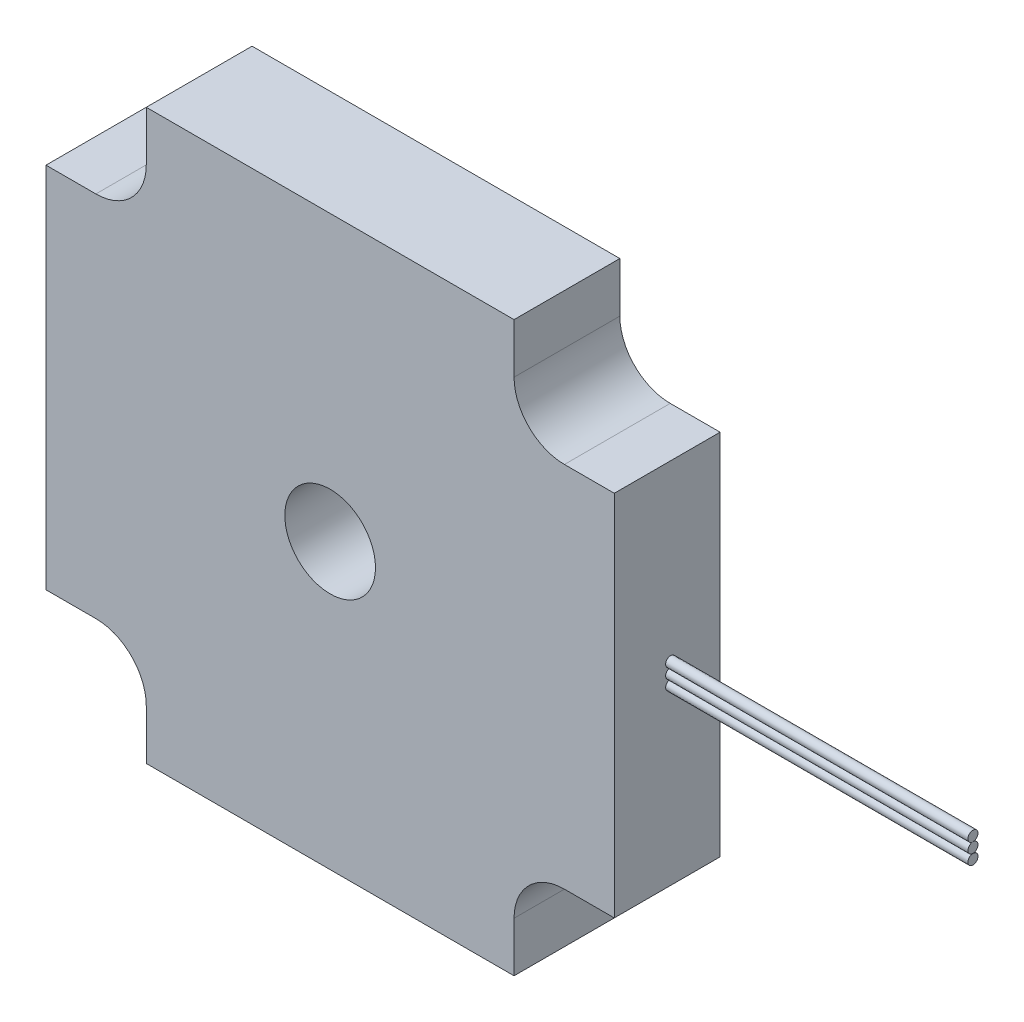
ISO-10303-21;
HEADER;
FILE_DESCRIPTION(('STEP AP214'),'2;1');
FILE_NAME('part.step','',(''),(''),'','','');
FILE_SCHEMA(('AUTOMOTIVE_DESIGN { 1 0 10303 214 1 1 1 1 }'));
ENDSEC;
DATA;
#1=APPLICATION_CONTEXT('core data for automotive mechanical design processes');
#2=APPLICATION_PROTOCOL_DEFINITION('international standard','automotive_design',2000,#1);
#3=PRODUCT_CONTEXT('',#1,'mechanical');
#4=PRODUCT('Part','Part','',(#3));
#5=PRODUCT_RELATED_PRODUCT_CATEGORY('part','',(#4));
#6=PRODUCT_DEFINITION_FORMATION('','',#4);
#7=PRODUCT_DEFINITION_CONTEXT('part definition',#1,'design');
#8=PRODUCT_DEFINITION('design','',#6,#7);
#9=PRODUCT_DEFINITION_SHAPE('','',#8);
#10=(LENGTH_UNIT() NAMED_UNIT(*) SI_UNIT(.MILLI.,.METRE.));
#11=(NAMED_UNIT(*) PLANE_ANGLE_UNIT() SI_UNIT($,.RADIAN.));
#12=(NAMED_UNIT(*) SI_UNIT($,.STERADIAN.) SOLID_ANGLE_UNIT());
#13=UNCERTAINTY_MEASURE_WITH_UNIT(LENGTH_MEASURE(1.E-05),#10,'distance_accuracy_value','');
#14=(GEOMETRIC_REPRESENTATION_CONTEXT(3) GLOBAL_UNCERTAINTY_ASSIGNED_CONTEXT((#13)) GLOBAL_UNIT_ASSIGNED_CONTEXT((#10,
#11,#12)) REPRESENTATION_CONTEXT('',''));
#15=CARTESIAN_POINT('',(0.,0.,0.));
#16=DIRECTION('',(0.,0.,1.));
#17=DIRECTION('',(1.,0.,0.));
#18=AXIS2_PLACEMENT_3D('',#15,#16,#17);
#19=CARTESIAN_POINT('',(58.2,0.999999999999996,4.90641702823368));
#20=DIRECTION('',(-1.,0.,0.));
#21=DIRECTION('',(0.,-1.,0.));
#22=AXIS2_PLACEMENT_3D('',#19,#20,#21);
#23=CYLINDRICAL_SURFACE('',#22,0.500000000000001);
#24=CARTESIAN_POINT('',(28.2,0.999999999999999,4.90641702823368));
#25=DIRECTION('',(1.,0.,0.));
#26=DIRECTION('',(0.,1.,0.));
#27=AXIS2_PLACEMENT_3D('',#24,#25,#26);
#28=CIRCLE('',#27,0.500000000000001);
#29=CARTESIAN_POINT('',(28.2,1.5,4.90641702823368));
#30=VERTEX_POINT('',#29);
#31=EDGE_CURVE('E11',#30,#30,#28,.T.);
#32=ORIENTED_EDGE('',*,*,#31,.T.);
#33=EDGE_LOOP('',(#32));
#34=FACE_BOUND('',#33,.T.);
#35=CARTESIAN_POINT('',(58.2,0.999999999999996,4.90641702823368));
#36=DIRECTION('',(1.,0.,0.));
#37=DIRECTION('',(0.,1.,0.));
#38=AXIS2_PLACEMENT_3D('',#35,#36,#37);
#39=CIRCLE('',#38,0.500000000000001);
#40=CARTESIAN_POINT('',(58.2,1.5,4.90641702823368));
#41=VERTEX_POINT('',#40);
#42=EDGE_CURVE('E46',#41,#41,#39,.T.);
#43=ORIENTED_EDGE('',*,*,#42,.F.);
#44=EDGE_LOOP('',(#43));
#45=FACE_BOUND('',#44,.T.);
#46=ADVANCED_FACE('F42',(#34,#45),#23,.T.);
#47=CARTESIAN_POINT('',(58.2,0.999999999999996,4.90641702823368));
#48=DIRECTION('',(1.,0.,0.));
#49=DIRECTION('',(0.,1.,0.));
#50=AXIS2_PLACEMENT_3D('',#47,#48,#49);
#51=PLANE('',#50);
#52=ORIENTED_EDGE('',*,*,#42,.T.);
#53=EDGE_LOOP('',(#52));
#54=FACE_BOUND('',#53,.T.);
#55=ADVANCED_FACE('F44',(#54),#51,.T.);
#56=CARTESIAN_POINT('',(28.2,0.999999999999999,4.90641702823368));
#57=DIRECTION('',(1.,0.,0.));
#58=DIRECTION('',(0.,1.,0.));
#59=AXIS2_PLACEMENT_3D('',#56,#57,#58);
#60=PLANE('',#59);
#61=ORIENTED_EDGE('',*,*,#31,.F.);
#62=EDGE_LOOP('',(#61));
#63=FACE_BOUND('',#62,.T.);
#64=ADVANCED_FACE('F61',(#63),#60,.F.);
#65=CLOSED_SHELL('',(#46,#55,#64));
#66=MANIFOLD_SOLID_BREP('B2',#65);
#67=CARTESIAN_POINT('',(58.2,-1.00000000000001,4.90641702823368));
#68=DIRECTION('',(-1.,0.,0.));
#69=DIRECTION('',(0.,-1.,0.));
#70=AXIS2_PLACEMENT_3D('',#67,#68,#69);
#71=CYLINDRICAL_SURFACE('',#70,0.500000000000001);
#72=CARTESIAN_POINT('',(28.2,-1.,4.90641702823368));
#73=DIRECTION('',(1.,0.,0.));
#74=DIRECTION('',(0.,1.,0.));
#75=AXIS2_PLACEMENT_3D('',#72,#73,#74);
#76=CIRCLE('',#75,0.500000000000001);
#77=CARTESIAN_POINT('',(28.2,-0.500000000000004,4.90641702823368));
#78=VERTEX_POINT('',#77);
#79=EDGE_CURVE('E41',#78,#78,#76,.T.);
#80=ORIENTED_EDGE('',*,*,#79,.T.);
#81=EDGE_LOOP('',(#80));
#82=FACE_BOUND('',#81,.T.);
#83=CARTESIAN_POINT('',(58.2,-1.00000000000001,4.90641702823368));
#84=DIRECTION('',(1.,0.,0.));
#85=DIRECTION('',(0.,1.,0.));
#86=AXIS2_PLACEMENT_3D('',#83,#84,#85);
#87=CIRCLE('',#86,0.500000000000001);
#88=CARTESIAN_POINT('',(58.2,-0.500000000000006,4.90641702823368));
#89=VERTEX_POINT('',#88);
#90=EDGE_CURVE('E95',#89,#89,#87,.T.);
#91=ORIENTED_EDGE('',*,*,#90,.F.);
#92=EDGE_LOOP('',(#91));
#93=FACE_BOUND('',#92,.T.);
#94=ADVANCED_FACE('F91',(#82,#93),#71,.T.);
#95=CARTESIAN_POINT('',(58.2,-1.00000000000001,4.90641702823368));
#96=DIRECTION('',(1.,0.,0.));
#97=DIRECTION('',(0.,1.,0.));
#98=AXIS2_PLACEMENT_3D('',#95,#96,#97);
#99=PLANE('',#98);
#100=ORIENTED_EDGE('',*,*,#90,.T.);
#101=EDGE_LOOP('',(#100));
#102=FACE_BOUND('',#101,.T.);
#103=ADVANCED_FACE('F93',(#102),#99,.T.);
#104=CARTESIAN_POINT('',(28.2,-1.,4.90641702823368));
#105=DIRECTION('',(1.,0.,0.));
#106=DIRECTION('',(0.,1.,0.));
#107=AXIS2_PLACEMENT_3D('',#104,#105,#106);
#108=PLANE('',#107);
#109=ORIENTED_EDGE('',*,*,#79,.F.);
#110=EDGE_LOOP('',(#109));
#111=FACE_BOUND('',#110,.T.);
#112=ADVANCED_FACE('F110',(#111),#108,.F.);
#113=CLOSED_SHELL('',(#94,#103,#112));
#114=MANIFOLD_SOLID_BREP('B6',#113);
#115=CARTESIAN_POINT('',(58.2,0.,4.90641702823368));
#116=DIRECTION('',(-1.,0.,0.));
#117=DIRECTION('',(0.,-1.,0.));
#118=AXIS2_PLACEMENT_3D('',#115,#116,#117);
#119=CYLINDRICAL_SURFACE('',#118,0.500000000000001);
#120=CARTESIAN_POINT('',(28.2,0.,4.90641702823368));
#121=DIRECTION('',(1.,0.,0.));
#122=DIRECTION('',(0.,1.,0.));
#123=AXIS2_PLACEMENT_3D('',#120,#121,#122);
#124=CIRCLE('',#123,0.500000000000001);
#125=CARTESIAN_POINT('',(28.2,0.499999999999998,4.90641702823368));
#126=VERTEX_POINT('',#125);
#127=EDGE_CURVE('E144',#126,#126,#124,.T.);
#128=ORIENTED_EDGE('',*,*,#127,.T.);
#129=EDGE_LOOP('',(#128));
#130=FACE_BOUND('',#129,.T.);
#131=CARTESIAN_POINT('',(58.2,0.,4.90641702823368));
#132=DIRECTION('',(1.,0.,0.));
#133=DIRECTION('',(0.,1.,0.));
#134=AXIS2_PLACEMENT_3D('',#131,#132,#133);
#135=CIRCLE('',#134,0.500000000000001);
#136=CARTESIAN_POINT('',(58.2,0.499999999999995,4.90641702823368));
#137=VERTEX_POINT('',#136);
#138=EDGE_CURVE('E90',#137,#137,#135,.T.);
#139=ORIENTED_EDGE('',*,*,#138,.F.);
#140=EDGE_LOOP('',(#139));
#141=FACE_BOUND('',#140,.T.);
#142=ADVANCED_FACE('F141',(#130,#141),#119,.T.);
#143=CARTESIAN_POINT('',(58.2,0.,4.90641702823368));
#144=DIRECTION('',(1.,0.,0.));
#145=DIRECTION('',(0.,1.,0.));
#146=AXIS2_PLACEMENT_3D('',#143,#144,#145);
#147=PLANE('',#146);
#148=ORIENTED_EDGE('',*,*,#138,.T.);
#149=EDGE_LOOP('',(#148));
#150=FACE_BOUND('',#149,.T.);
#151=ADVANCED_FACE('F157',(#150),#147,.T.);
#152=CARTESIAN_POINT('',(28.2,0.,4.90641702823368));
#153=DIRECTION('',(1.,0.,0.));
#154=DIRECTION('',(0.,1.,0.));
#155=AXIS2_PLACEMENT_3D('',#152,#153,#154);
#156=PLANE('',#155);
#157=ORIENTED_EDGE('',*,*,#127,.F.);
#158=EDGE_LOOP('',(#157));
#159=FACE_BOUND('',#158,.T.);
#160=ADVANCED_FACE('F155',(#159),#156,.F.);
#161=CLOSED_SHELL('',(#142,#151,#160));
#162=MANIFOLD_SOLID_BREP('B36',#161);
#163=CARTESIAN_POINT('',(-28.2,-18.25,10.5));
#164=DIRECTION('',(1.,0.,0.));
#165=DIRECTION('',(0.,0.,-1.));
#166=AXIS2_PLACEMENT_3D('',#163,#164,#165);
#167=PLANE('',#166);
#168=DIRECTION('',(0.,-1.,0.));
#169=VECTOR('',#168,1.);
#170=CARTESIAN_POINT('',(-28.2,-18.25,0.));
#171=LINE('',#170,#169);
#172=CARTESIAN_POINT('',(-28.2,18.25,0.));
#173=VERTEX_POINT('',#172);
#174=CARTESIAN_POINT('',(-28.2,-18.25,0.));
#175=VERTEX_POINT('',#174);
#176=EDGE_CURVE('E319',#173,#175,#171,.T.);
#177=ORIENTED_EDGE('',*,*,#176,.T.);
#178=DIRECTION('',(0.,0.,-1.));
#179=VECTOR('',#178,1.);
#180=CARTESIAN_POINT('',(-28.2,-18.25,10.5));
#181=LINE('',#180,#179);
#182=CARTESIAN_POINT('',(-28.2,-18.25,10.5));
#183=VERTEX_POINT('',#182);
#184=EDGE_CURVE('E300',#183,#175,#181,.T.);
#185=ORIENTED_EDGE('',*,*,#184,.F.);
#186=DIRECTION('',(0.,-1.,0.));
#187=VECTOR('',#186,1.);
#188=CARTESIAN_POINT('',(-28.2,-18.25,10.5));
#189=LINE('',#188,#187);
#190=CARTESIAN_POINT('',(-28.2,18.25,10.5));
#191=VERTEX_POINT('',#190);
#192=EDGE_CURVE('E307',#191,#183,#189,.T.);
#193=ORIENTED_EDGE('',*,*,#192,.F.);
#194=DIRECTION('',(0.,0.,-1.));
#195=VECTOR('',#194,1.);
#196=CARTESIAN_POINT('',(-28.2,18.25,10.5));
#197=LINE('',#196,#195);
#198=EDGE_CURVE('E366',#191,#173,#197,.T.);
#199=ORIENTED_EDGE('',*,*,#198,.T.);
#200=EDGE_LOOP('',(#177,#185,#193,#199));
#201=FACE_BOUND('',#200,.T.);
#202=ADVANCED_FACE('F182',(#201),#167,.F.);
#203=CARTESIAN_POINT('',(-18.25,-18.25,10.5));
#204=DIRECTION('',(0.,1.,0.));
#205=DIRECTION('',(-1.,0.,0.));
#206=AXIS2_PLACEMENT_3D('',#203,#204,#205);
#207=PLANE('',#206);
#208=DIRECTION('',(1.,0.,0.));
#209=VECTOR('',#208,1.);
#210=CARTESIAN_POINT('',(-18.25,-18.25,0.));
#211=LINE('',#210,#209);
#212=CARTESIAN_POINT('',(-23.25,-18.25,0.));
#213=VERTEX_POINT('',#212);
#214=EDGE_CURVE('E440',#175,#213,#211,.T.);
#215=ORIENTED_EDGE('',*,*,#214,.T.);
#216=DIRECTION('',(0.,0.,-1.));
#217=VECTOR('',#216,1.);
#218=CARTESIAN_POINT('',(-23.25,-18.25,10.5));
#219=LINE('',#218,#217);
#220=CARTESIAN_POINT('',(-23.25,-18.25,10.5));
#221=VERTEX_POINT('',#220);
#222=EDGE_CURVE('E303',#213,#221,#219,.F.);
#223=ORIENTED_EDGE('',*,*,#222,.T.);
#224=DIRECTION('',(1.,0.,0.));
#225=VECTOR('',#224,1.);
#226=CARTESIAN_POINT('',(-18.25,-18.25,10.5));
#227=LINE('',#226,#225);
#228=EDGE_CURVE('E295',#183,#221,#227,.T.);
#229=ORIENTED_EDGE('',*,*,#228,.F.);
#230=ORIENTED_EDGE('',*,*,#184,.T.);
#231=EDGE_LOOP('',(#215,#223,#229,#230));
#232=FACE_BOUND('',#231,.T.);
#233=ADVANCED_FACE('F298',(#232),#207,.F.);
#234=CARTESIAN_POINT('',(-18.25,-28.2,10.5));
#235=DIRECTION('',(1.,0.,0.));
#236=DIRECTION('',(0.,1.,0.));
#237=AXIS2_PLACEMENT_3D('',#234,#235,#236);
#238=PLANE('',#237);
#239=DIRECTION('',(0.,-1.,0.));
#240=VECTOR('',#239,1.);
#241=CARTESIAN_POINT('',(-18.25,-28.2,10.5));
#242=LINE('',#241,#240);
#243=CARTESIAN_POINT('',(-18.25,-23.25,10.5));
#244=VERTEX_POINT('',#243);
#245=CARTESIAN_POINT('',(-18.25,-28.2,10.5));
#246=VERTEX_POINT('',#245);
#247=EDGE_CURVE('E306',#244,#246,#242,.T.);
#248=ORIENTED_EDGE('',*,*,#247,.F.);
#249=DIRECTION('',(0.,0.,-1.));
#250=VECTOR('',#249,1.);
#251=CARTESIAN_POINT('',(-18.25,-23.25,0.));
#252=LINE('',#251,#250);
#253=CARTESIAN_POINT('',(-18.25,-23.25,0.));
#254=VERTEX_POINT('',#253);
#255=EDGE_CURVE('E332',#244,#254,#252,.T.);
#256=ORIENTED_EDGE('',*,*,#255,.T.);
#257=DIRECTION('',(0.,-1.,0.));
#258=VECTOR('',#257,1.);
#259=CARTESIAN_POINT('',(-18.25,-28.2,0.));
#260=LINE('',#259,#258);
#261=CARTESIAN_POINT('',(-18.25,-28.2,0.));
#262=VERTEX_POINT('',#261);
#263=EDGE_CURVE('E417',#254,#262,#260,.T.);
#264=ORIENTED_EDGE('',*,*,#263,.T.);
#265=DIRECTION('',(0.,0.,-1.));
#266=VECTOR('',#265,1.);
#267=CARTESIAN_POINT('',(-18.25,-28.2,10.5));
#268=LINE('',#267,#266);
#269=EDGE_CURVE('E321',#246,#262,#268,.T.);
#270=ORIENTED_EDGE('',*,*,#269,.F.);
#271=EDGE_LOOP('',(#248,#256,#264,#270));
#272=FACE_BOUND('',#271,.T.);
#273=ADVANCED_FACE('F445',(#272),#238,.F.);
#274=CARTESIAN_POINT('',(18.25,-28.2,10.5));
#275=DIRECTION('',(0.,1.,0.));
#276=DIRECTION('',(0.,0.,1.));
#277=AXIS2_PLACEMENT_3D('',#274,#275,#276);
#278=PLANE('',#277);
#279=DIRECTION('',(1.,0.,0.));
#280=VECTOR('',#279,1.);
#281=CARTESIAN_POINT('',(18.25,-28.2,0.));
#282=LINE('',#281,#280);
#283=CARTESIAN_POINT('',(18.25,-28.2,0.));
#284=VERTEX_POINT('',#283);
#285=EDGE_CURVE('E411',#262,#284,#282,.T.);
#286=ORIENTED_EDGE('',*,*,#285,.T.);
#287=DIRECTION('',(0.,0.,-1.));
#288=VECTOR('',#287,1.);
#289=CARTESIAN_POINT('',(18.25,-28.2,10.5));
#290=LINE('',#289,#288);
#291=CARTESIAN_POINT('',(18.25,-28.2,10.5));
#292=VERTEX_POINT('',#291);
#293=EDGE_CURVE('E327',#292,#284,#290,.T.);
#294=ORIENTED_EDGE('',*,*,#293,.F.);
#295=DIRECTION('',(1.,0.,0.));
#296=VECTOR('',#295,1.);
#297=CARTESIAN_POINT('',(18.25,-28.2,10.5));
#298=LINE('',#297,#296);
#299=EDGE_CURVE('E448',#246,#292,#298,.T.);
#300=ORIENTED_EDGE('',*,*,#299,.F.);
#301=ORIENTED_EDGE('',*,*,#269,.T.);
#302=EDGE_LOOP('',(#286,#294,#300,#301));
#303=FACE_BOUND('',#302,.T.);
#304=ADVANCED_FACE('F447',(#303),#278,.F.);
#305=CARTESIAN_POINT('',(18.25,-28.2,10.5));
#306=DIRECTION('',(-1.,0.,0.));
#307=DIRECTION('',(0.,0.,1.));
#308=AXIS2_PLACEMENT_3D('',#305,#306,#307);
#309=PLANE('',#308);
#310=DIRECTION('',(0.,1.,0.));
#311=VECTOR('',#310,1.);
#312=CARTESIAN_POINT('',(18.25,-28.2,0.));
#313=LINE('',#312,#311);
#314=CARTESIAN_POINT('',(18.25,-23.25,0.));
#315=VERTEX_POINT('',#314);
#316=EDGE_CURVE('E403',#284,#315,#313,.T.);
#317=ORIENTED_EDGE('',*,*,#316,.T.);
#318=DIRECTION('',(0.,0.,-1.));
#319=VECTOR('',#318,1.);
#320=CARTESIAN_POINT('',(18.25,-23.25,10.5));
#321=LINE('',#320,#319);
#322=CARTESIAN_POINT('',(18.25,-23.25,10.5));
#323=VERTEX_POINT('',#322);
#324=EDGE_CURVE('E324',#315,#323,#321,.F.);
#325=ORIENTED_EDGE('',*,*,#324,.T.);
#326=DIRECTION('',(0.,1.,0.));
#327=VECTOR('',#326,1.);
#328=CARTESIAN_POINT('',(18.25,-28.2,10.5));
#329=LINE('',#328,#327);
#330=EDGE_CURVE('E406',#292,#323,#329,.T.);
#331=ORIENTED_EDGE('',*,*,#330,.F.);
#332=ORIENTED_EDGE('',*,*,#293,.T.);
#333=EDGE_LOOP('',(#317,#325,#331,#332));
#334=FACE_BOUND('',#333,.T.);
#335=ADVANCED_FACE('F402',(#334),#309,.F.);
#336=CARTESIAN_POINT('',(28.2,-18.25,10.5));
#337=DIRECTION('',(0.,1.,0.));
#338=DIRECTION('',(-1.,0.,0.));
#339=AXIS2_PLACEMENT_3D('',#336,#337,#338);
#340=PLANE('',#339);
#341=DIRECTION('',(1.,0.,0.));
#342=VECTOR('',#341,1.);
#343=CARTESIAN_POINT('',(28.2,-18.25,10.5));
#344=LINE('',#343,#342);
#345=CARTESIAN_POINT('',(23.25,-18.25,10.5));
#346=VERTEX_POINT('',#345);
#347=CARTESIAN_POINT('',(28.2,-18.25,10.5));
#348=VERTEX_POINT('',#347);
#349=EDGE_CURVE('E450',#346,#348,#344,.T.);
#350=ORIENTED_EDGE('',*,*,#349,.F.);
#351=DIRECTION('',(0.,0.,-1.));
#352=VECTOR('',#351,1.);
#353=CARTESIAN_POINT('',(23.25,-18.25,0.));
#354=LINE('',#353,#352);
#355=CARTESIAN_POINT('',(23.25,-18.25,0.));
#356=VERTEX_POINT('',#355);
#357=EDGE_CURVE('E320',#346,#356,#354,.T.);
#358=ORIENTED_EDGE('',*,*,#357,.T.);
#359=DIRECTION('',(1.,0.,0.));
#360=VECTOR('',#359,1.);
#361=CARTESIAN_POINT('',(28.2,-18.25,0.));
#362=LINE('',#361,#360);
#363=CARTESIAN_POINT('',(28.2,-18.25,0.));
#364=VERTEX_POINT('',#363);
#365=EDGE_CURVE('E413',#356,#364,#362,.T.);
#366=ORIENTED_EDGE('',*,*,#365,.T.);
#367=DIRECTION('',(0.,0.,-1.));
#368=VECTOR('',#367,1.);
#369=CARTESIAN_POINT('',(28.2,-18.25,10.5));
#370=LINE('',#369,#368);
#371=EDGE_CURVE('E394',#348,#364,#370,.T.);
#372=ORIENTED_EDGE('',*,*,#371,.F.);
#373=EDGE_LOOP('',(#350,#358,#366,#372));
#374=FACE_BOUND('',#373,.T.);
#375=ADVANCED_FACE('F571',(#374),#340,.F.);
#376=CARTESIAN_POINT('',(28.2,-18.25,10.5));
#377=DIRECTION('',(-1.,0.,0.));
#378=DIRECTION('',(0.,-1.,0.));
#379=AXIS2_PLACEMENT_3D('',#376,#377,#378);
#380=PLANE('',#379);
#381=DIRECTION('',(0.,1.,0.));
#382=VECTOR('',#381,1.);
#383=CARTESIAN_POINT('',(28.2,-18.25,0.));
#384=LINE('',#383,#382);
#385=CARTESIAN_POINT('',(28.2,18.25,0.));
#386=VERTEX_POINT('',#385);
#387=EDGE_CURVE('E415',#364,#386,#384,.T.);
#388=ORIENTED_EDGE('',*,*,#387,.T.);
#389=DIRECTION('',(0.,0.,-1.));
#390=VECTOR('',#389,1.);
#391=CARTESIAN_POINT('',(28.2,18.25,10.5));
#392=LINE('',#391,#390);
#393=CARTESIAN_POINT('',(28.2,18.25,10.5));
#394=VERTEX_POINT('',#393);
#395=EDGE_CURVE('E391',#394,#386,#392,.T.);
#396=ORIENTED_EDGE('',*,*,#395,.F.);
#397=DIRECTION('',(0.,1.,0.));
#398=VECTOR('',#397,1.);
#399=CARTESIAN_POINT('',(28.2,-18.25,10.5));
#400=LINE('',#399,#398);
#401=EDGE_CURVE('E455',#348,#394,#400,.T.);
#402=ORIENTED_EDGE('',*,*,#401,.F.);
#403=ORIENTED_EDGE('',*,*,#371,.T.);
#404=EDGE_LOOP('',(#388,#396,#402,#403));
#405=FACE_BOUND('',#404,.T.);
#406=ADVANCED_FACE('F563',(#405),#380,.F.);
#407=CARTESIAN_POINT('',(28.2,18.25,10.5));
#408=DIRECTION('',(0.,-1.,0.));
#409=DIRECTION('',(0.,0.,-1.));
#410=AXIS2_PLACEMENT_3D('',#407,#408,#409);
#411=PLANE('',#410);
#412=DIRECTION('',(-1.,0.,0.));
#413=VECTOR('',#412,1.);
#414=CARTESIAN_POINT('',(28.2,18.25,0.));
#415=LINE('',#414,#413);
#416=CARTESIAN_POINT('',(23.25,18.25,0.));
#417=VERTEX_POINT('',#416);
#418=EDGE_CURVE('E422',#386,#417,#415,.T.);
#419=ORIENTED_EDGE('',*,*,#418,.T.);
#420=DIRECTION('',(0.,0.,-1.));
#421=VECTOR('',#420,1.);
#422=CARTESIAN_POINT('',(23.25,18.25,10.5));
#423=LINE('',#422,#421);
#424=CARTESIAN_POINT('',(23.25,18.25,10.5));
#425=VERTEX_POINT('',#424);
#426=EDGE_CURVE('E197',#417,#425,#423,.F.);
#427=ORIENTED_EDGE('',*,*,#426,.T.);
#428=DIRECTION('',(-1.,0.,0.));
#429=VECTOR('',#428,1.);
#430=CARTESIAN_POINT('',(28.2,18.25,10.5));
#431=LINE('',#430,#429);
#432=EDGE_CURVE('E435',#394,#425,#431,.T.);
#433=ORIENTED_EDGE('',*,*,#432,.F.);
#434=ORIENTED_EDGE('',*,*,#395,.T.);
#435=EDGE_LOOP('',(#419,#427,#433,#434));
#436=FACE_BOUND('',#435,.T.);
#437=ADVANCED_FACE('F555',(#436),#411,.F.);
#438=CARTESIAN_POINT('',(18.25,18.25,10.5));
#439=DIRECTION('',(-1.,0.,0.));
#440=DIRECTION('',(0.,-1.,0.));
#441=AXIS2_PLACEMENT_3D('',#438,#439,#440);
#442=PLANE('',#441);
#443=DIRECTION('',(0.,1.,0.));
#444=VECTOR('',#443,1.);
#445=CARTESIAN_POINT('',(18.25,18.25,10.5));
#446=LINE('',#445,#444);
#447=CARTESIAN_POINT('',(18.25,23.25,10.5));
#448=VERTEX_POINT('',#447);
#449=CARTESIAN_POINT('',(18.25,28.2,10.5));
#450=VERTEX_POINT('',#449);
#451=EDGE_CURVE('E432',#448,#450,#446,.T.);
#452=ORIENTED_EDGE('',*,*,#451,.F.);
#453=DIRECTION('',(0.,0.,-1.));
#454=VECTOR('',#453,1.);
#455=CARTESIAN_POINT('',(18.25,23.25,0.));
#456=LINE('',#455,#454);
#457=CARTESIAN_POINT('',(18.25,23.25,0.));
#458=VERTEX_POINT('',#457);
#459=EDGE_CURVE('E341',#448,#458,#456,.T.);
#460=ORIENTED_EDGE('',*,*,#459,.T.);
#461=DIRECTION('',(0.,1.,0.));
#462=VECTOR('',#461,1.);
#463=CARTESIAN_POINT('',(18.25,18.25,0.));
#464=LINE('',#463,#462);
#465=CARTESIAN_POINT('',(18.25,28.2,0.));
#466=VERTEX_POINT('',#465);
#467=EDGE_CURVE('E382',#458,#466,#464,.T.);
#468=ORIENTED_EDGE('',*,*,#467,.T.);
#469=DIRECTION('',(0.,0.,-1.));
#470=VECTOR('',#469,1.);
#471=CARTESIAN_POINT('',(18.25,28.2,10.5));
#472=LINE('',#471,#470);
#473=EDGE_CURVE('E388',#450,#466,#472,.T.);
#474=ORIENTED_EDGE('',*,*,#473,.F.);
#475=EDGE_LOOP('',(#452,#460,#468,#474));
#476=FACE_BOUND('',#475,.T.);
#477=ADVANCED_FACE('F426',(#476),#442,.F.);
#478=CARTESIAN_POINT('',(18.25,28.2,10.5));
#479=DIRECTION('',(0.,-1.,0.));
#480=DIRECTION('',(0.,0.,-1.));
#481=AXIS2_PLACEMENT_3D('',#478,#479,#480);
#482=PLANE('',#481);
#483=DIRECTION('',(-1.,0.,0.));
#484=VECTOR('',#483,1.);
#485=CARTESIAN_POINT('',(18.25,28.2,0.));
#486=LINE('',#485,#484);
#487=CARTESIAN_POINT('',(-18.25,28.2,0.));
#488=VERTEX_POINT('',#487);
#489=EDGE_CURVE('E379',#466,#488,#486,.T.);
#490=ORIENTED_EDGE('',*,*,#489,.T.);
#491=DIRECTION('',(0.,0.,-1.));
#492=VECTOR('',#491,1.);
#493=CARTESIAN_POINT('',(-18.25,28.2,10.5));
#494=LINE('',#493,#492);
#495=CARTESIAN_POINT('',(-18.25,28.2,10.5));
#496=VERTEX_POINT('',#495);
#497=EDGE_CURVE('E378',#496,#488,#494,.T.);
#498=ORIENTED_EDGE('',*,*,#497,.F.);
#499=DIRECTION('',(-1.,0.,0.));
#500=VECTOR('',#499,1.);
#501=CARTESIAN_POINT('',(18.25,28.2,10.5));
#502=LINE('',#501,#500);
#503=EDGE_CURVE('E431',#450,#496,#502,.T.);
#504=ORIENTED_EDGE('',*,*,#503,.F.);
#505=ORIENTED_EDGE('',*,*,#473,.T.);
#506=EDGE_LOOP('',(#490,#498,#504,#505));
#507=FACE_BOUND('',#506,.T.);
#508=ADVANCED_FACE('F430',(#507),#482,.F.);
#509=CARTESIAN_POINT('',(-18.25,18.25,10.5));
#510=DIRECTION('',(1.,0.,0.));
#511=DIRECTION('',(0.,1.,0.));
#512=AXIS2_PLACEMENT_3D('',#509,#510,#511);
#513=PLANE('',#512);
#514=DIRECTION('',(0.,-1.,0.));
#515=VECTOR('',#514,1.);
#516=CARTESIAN_POINT('',(-18.25,18.25,0.));
#517=LINE('',#516,#515);
#518=CARTESIAN_POINT('',(-18.25,23.25,0.));
#519=VERTEX_POINT('',#518);
#520=EDGE_CURVE('E373',#488,#519,#517,.T.);
#521=ORIENTED_EDGE('',*,*,#520,.T.);
#522=DIRECTION('',(0.,0.,-1.));
#523=VECTOR('',#522,1.);
#524=CARTESIAN_POINT('',(-18.25,23.25,10.5));
#525=LINE('',#524,#523);
#526=CARTESIAN_POINT('',(-18.25,23.25,10.5));
#527=VERTEX_POINT('',#526);
#528=EDGE_CURVE('E339',#519,#527,#525,.F.);
#529=ORIENTED_EDGE('',*,*,#528,.T.);
#530=DIRECTION('',(0.,-1.,0.));
#531=VECTOR('',#530,1.);
#532=CARTESIAN_POINT('',(-18.25,18.25,10.5));
#533=LINE('',#532,#531);
#534=EDGE_CURVE('E359',#496,#527,#533,.T.);
#535=ORIENTED_EDGE('',*,*,#534,.F.);
#536=ORIENTED_EDGE('',*,*,#497,.T.);
#537=EDGE_LOOP('',(#521,#529,#535,#536));
#538=FACE_BOUND('',#537,.T.);
#539=ADVANCED_FACE('F376',(#538),#513,.F.);
#540=CARTESIAN_POINT('',(-18.25,18.25,10.5));
#541=DIRECTION('',(0.,-1.,0.));
#542=DIRECTION('',(1.,0.,0.));
#543=AXIS2_PLACEMENT_3D('',#540,#541,#542);
#544=PLANE('',#543);
#545=DIRECTION('',(-1.,0.,0.));
#546=VECTOR('',#545,1.);
#547=CARTESIAN_POINT('',(-18.25,18.25,10.5));
#548=LINE('',#547,#546);
#549=CARTESIAN_POINT('',(-23.25,18.25,10.5));
#550=VERTEX_POINT('',#549);
#551=EDGE_CURVE('E312',#550,#191,#548,.T.);
#552=ORIENTED_EDGE('',*,*,#551,.F.);
#553=DIRECTION('',(0.,0.,-1.));
#554=VECTOR('',#553,1.);
#555=CARTESIAN_POINT('',(-23.25,18.25,0.));
#556=LINE('',#555,#554);
#557=CARTESIAN_POINT('',(-23.25,18.25,0.));
#558=VERTEX_POINT('',#557);
#559=EDGE_CURVE('E336',#550,#558,#556,.T.);
#560=ORIENTED_EDGE('',*,*,#559,.T.);
#561=DIRECTION('',(-1.,0.,0.));
#562=VECTOR('',#561,1.);
#563=CARTESIAN_POINT('',(-18.25,18.25,0.));
#564=LINE('',#563,#562);
#565=EDGE_CURVE('E316',#558,#173,#564,.T.);
#566=ORIENTED_EDGE('',*,*,#565,.T.);
#567=ORIENTED_EDGE('',*,*,#198,.F.);
#568=EDGE_LOOP('',(#552,#560,#566,#567));
#569=FACE_BOUND('',#568,.T.);
#570=ADVANCED_FACE('F364',(#569),#544,.F.);
#571=CARTESIAN_POINT('',(0.,0.,10.5));
#572=DIRECTION('',(0.,0.,1.));
#573=DIRECTION('',(1.,0.,0.));
#574=AXIS2_PLACEMENT_3D('',#571,#572,#573);
#575=PLANE('',#574);
#576=CARTESIAN_POINT('',(0.,0.,10.5));
#577=DIRECTION('',(0.,0.,1.));
#578=DIRECTION('',(1.,0.,0.));
#579=AXIS2_PLACEMENT_3D('',#576,#577,#578);
#580=CIRCLE('',#579,4.5);
#581=CARTESIAN_POINT('',(4.5,0.,10.5));
#582=VERTEX_POINT('',#581);
#583=EDGE_CURVE('E630',#582,#582,#580,.T.);
#584=ORIENTED_EDGE('',*,*,#583,.F.);
#585=EDGE_LOOP('',(#584));
#586=FACE_BOUND('',#585,.T.);
#587=ORIENTED_EDGE('',*,*,#192,.T.);
#588=ORIENTED_EDGE('',*,*,#228,.T.);
#589=CARTESIAN_POINT('',(-23.25,-23.25,10.5));
#590=DIRECTION('',(0.,0.,1.));
#591=DIRECTION('',(1.,0.,0.));
#592=AXIS2_PLACEMENT_3D('',#589,#590,#591);
#593=CIRCLE('',#592,5.);
#594=EDGE_CURVE('E351',#221,#244,#593,.F.);
#595=ORIENTED_EDGE('',*,*,#594,.T.);
#596=ORIENTED_EDGE('',*,*,#247,.T.);
#597=ORIENTED_EDGE('',*,*,#299,.T.);
#598=ORIENTED_EDGE('',*,*,#330,.T.);
#599=CARTESIAN_POINT('',(23.25,-23.25,10.5));
#600=DIRECTION('',(0.,0.,1.));
#601=DIRECTION('',(1.,0.,0.));
#602=AXIS2_PLACEMENT_3D('',#599,#600,#601);
#603=CIRCLE('',#602,5.);
#604=EDGE_CURVE('E347',#323,#346,#603,.F.);
#605=ORIENTED_EDGE('',*,*,#604,.T.);
#606=ORIENTED_EDGE('',*,*,#349,.T.);
#607=ORIENTED_EDGE('',*,*,#401,.T.);
#608=ORIENTED_EDGE('',*,*,#432,.T.);
#609=CARTESIAN_POINT('',(23.25,23.25,10.5));
#610=DIRECTION('',(0.,0.,1.));
#611=DIRECTION('',(1.,0.,0.));
#612=AXIS2_PLACEMENT_3D('',#609,#610,#611);
#613=CIRCLE('',#612,5.);
#614=EDGE_CURVE('E139',#425,#448,#613,.F.);
#615=ORIENTED_EDGE('',*,*,#614,.T.);
#616=ORIENTED_EDGE('',*,*,#451,.T.);
#617=ORIENTED_EDGE('',*,*,#503,.T.);
#618=ORIENTED_EDGE('',*,*,#534,.T.);
#619=CARTESIAN_POINT('',(-23.25,23.25,10.5));
#620=DIRECTION('',(0.,0.,1.));
#621=DIRECTION('',(1.,0.,0.));
#622=AXIS2_PLACEMENT_3D('',#619,#620,#621);
#623=CIRCLE('',#622,5.);
#624=EDGE_CURVE('E355',#527,#550,#623,.F.);
#625=ORIENTED_EDGE('',*,*,#624,.T.);
#626=ORIENTED_EDGE('',*,*,#551,.T.);
#627=EDGE_LOOP('',(#587,#588,#595,#596,#597,#598,#605,#606,#607,#608,#615,#616,#617,#618,#625,#626));
#628=FACE_BOUND('',#627,.T.);
#629=ADVANCED_FACE('F310',(#586,#628),#575,.T.);
#630=CARTESIAN_POINT('',(0.,0.,0.));
#631=DIRECTION('',(0.,0.,1.));
#632=DIRECTION('',(1.,0.,0.));
#633=AXIS2_PLACEMENT_3D('',#630,#631,#632);
#634=PLANE('',#633);
#635=CARTESIAN_POINT('',(0.,0.,0.));
#636=DIRECTION('',(0.,0.,1.));
#637=DIRECTION('',(1.,0.,0.));
#638=AXIS2_PLACEMENT_3D('',#635,#636,#637);
#639=CIRCLE('',#638,4.5);
#640=CARTESIAN_POINT('',(4.5,0.,0.));
#641=VERTEX_POINT('',#640);
#642=EDGE_CURVE('E441',#641,#641,#639,.T.);
#643=ORIENTED_EDGE('',*,*,#642,.T.);
#644=EDGE_LOOP('',(#643));
#645=FACE_BOUND('',#644,.T.);
#646=ORIENTED_EDGE('',*,*,#176,.F.);
#647=ORIENTED_EDGE('',*,*,#565,.F.);
#648=CARTESIAN_POINT('',(-23.25,23.25,0.));
#649=DIRECTION('',(0.,0.,1.));
#650=DIRECTION('',(1.,0.,0.));
#651=AXIS2_PLACEMENT_3D('',#648,#649,#650);
#652=CIRCLE('',#651,5.);
#653=EDGE_CURVE('E353',#558,#519,#652,.T.);
#654=ORIENTED_EDGE('',*,*,#653,.T.);
#655=ORIENTED_EDGE('',*,*,#520,.F.);
#656=ORIENTED_EDGE('',*,*,#489,.F.);
#657=ORIENTED_EDGE('',*,*,#467,.F.);
#658=CARTESIAN_POINT('',(23.25,23.25,0.));
#659=DIRECTION('',(0.,0.,1.));
#660=DIRECTION('',(1.,0.,0.));
#661=AXIS2_PLACEMENT_3D('',#658,#659,#660);
#662=CIRCLE('',#661,5.);
#663=EDGE_CURVE('E190',#458,#417,#662,.T.);
#664=ORIENTED_EDGE('',*,*,#663,.T.);
#665=ORIENTED_EDGE('',*,*,#418,.F.);
#666=ORIENTED_EDGE('',*,*,#387,.F.);
#667=ORIENTED_EDGE('',*,*,#365,.F.);
#668=CARTESIAN_POINT('',(23.25,-23.25,0.));
#669=DIRECTION('',(0.,0.,1.));
#670=DIRECTION('',(1.,0.,0.));
#671=AXIS2_PLACEMENT_3D('',#668,#669,#670);
#672=CIRCLE('',#671,5.);
#673=EDGE_CURVE('E345',#356,#315,#672,.T.);
#674=ORIENTED_EDGE('',*,*,#673,.T.);
#675=ORIENTED_EDGE('',*,*,#316,.F.);
#676=ORIENTED_EDGE('',*,*,#285,.F.);
#677=ORIENTED_EDGE('',*,*,#263,.F.);
#678=CARTESIAN_POINT('',(-23.25,-23.25,0.));
#679=DIRECTION('',(0.,0.,1.));
#680=DIRECTION('',(1.,0.,0.));
#681=AXIS2_PLACEMENT_3D('',#678,#679,#680);
#682=CIRCLE('',#681,5.);
#683=EDGE_CURVE('E349',#254,#213,#682,.T.);
#684=ORIENTED_EDGE('',*,*,#683,.T.);
#685=ORIENTED_EDGE('',*,*,#214,.F.);
#686=EDGE_LOOP('',(#646,#647,#654,#655,#656,#657,#664,#665,#666,#667,#674,#675,#676,#677,#684,#685));
#687=FACE_BOUND('',#686,.T.);
#688=ADVANCED_FACE('F371',(#645,#687),#634,.F.);
#689=CARTESIAN_POINT('',(0.,0.,0.));
#690=DIRECTION('',(0.,0.,1.));
#691=DIRECTION('',(1.,0.,0.));
#692=AXIS2_PLACEMENT_3D('',#689,#690,#691);
#693=CYLINDRICAL_SURFACE('',#692,4.5);
#694=CARTESIAN_POINT('',(4.5,0.,0.));
#695=CARTESIAN_POINT('',(4.5,0.,0.109375));
#696=CARTESIAN_POINT('',(4.5,0.,0.21875));
#697=CARTESIAN_POINT('',(4.5,0.,0.4375));
#698=CARTESIAN_POINT('',(4.5,0.,0.546875));
#699=CARTESIAN_POINT('',(4.5,0.,0.765625));
#700=CARTESIAN_POINT('',(4.5,0.,0.875));
#701=CARTESIAN_POINT('',(4.5,0.,1.09375));
#702=CARTESIAN_POINT('',(4.5,0.,1.203125));
#703=CARTESIAN_POINT('',(4.5,0.,1.421875));
#704=CARTESIAN_POINT('',(4.5,0.,1.53125));
#705=CARTESIAN_POINT('',(4.5,0.,1.75));
#706=CARTESIAN_POINT('',(4.5,0.,1.859375));
#707=CARTESIAN_POINT('',(4.5,0.,2.078125));
#708=CARTESIAN_POINT('',(4.5,0.,2.1875));
#709=CARTESIAN_POINT('',(4.5,0.,2.40625));
#710=CARTESIAN_POINT('',(4.5,0.,2.515625));
#711=CARTESIAN_POINT('',(4.5,0.,2.734375));
#712=CARTESIAN_POINT('',(4.5,0.,2.84375));
#713=CARTESIAN_POINT('',(4.5,0.,3.0625));
#714=CARTESIAN_POINT('',(4.5,0.,3.171875));
#715=CARTESIAN_POINT('',(4.5,0.,3.390625));
#716=CARTESIAN_POINT('',(4.5,0.,3.5));
#717=CARTESIAN_POINT('',(4.5,0.,3.71875));
#718=CARTESIAN_POINT('',(4.5,0.,3.828125));
#719=CARTESIAN_POINT('',(4.5,0.,4.046875));
#720=CARTESIAN_POINT('',(4.5,0.,4.15625));
#721=CARTESIAN_POINT('',(4.5,0.,4.375));
#722=CARTESIAN_POINT('',(4.5,0.,4.484375));
#723=CARTESIAN_POINT('',(4.5,0.,4.703125));
#724=CARTESIAN_POINT('',(4.5,0.,4.8125));
#725=CARTESIAN_POINT('',(4.5,0.,5.03125));
#726=CARTESIAN_POINT('',(4.5,0.,5.140625));
#727=CARTESIAN_POINT('',(4.5,0.,5.359375));
#728=CARTESIAN_POINT('',(4.5,0.,5.46875));
#729=CARTESIAN_POINT('',(4.5,0.,5.6875));
#730=CARTESIAN_POINT('',(4.5,0.,5.796875));
#731=CARTESIAN_POINT('',(4.5,0.,6.015625));
#732=CARTESIAN_POINT('',(4.5,0.,6.125));
#733=CARTESIAN_POINT('',(4.5,0.,6.34375));
#734=CARTESIAN_POINT('',(4.5,0.,6.453125));
#735=CARTESIAN_POINT('',(4.5,0.,6.671875));
#736=CARTESIAN_POINT('',(4.5,0.,6.78125));
#737=CARTESIAN_POINT('',(4.5,0.,7.));
#738=CARTESIAN_POINT('',(4.5,0.,7.109375));
#739=CARTESIAN_POINT('',(4.5,0.,7.328125));
#740=CARTESIAN_POINT('',(4.5,0.,7.4375));
#741=CARTESIAN_POINT('',(4.5,0.,7.65625));
#742=CARTESIAN_POINT('',(4.5,0.,7.765625));
#743=CARTESIAN_POINT('',(4.5,0.,7.984375));
#744=CARTESIAN_POINT('',(4.5,0.,8.09375));
#745=CARTESIAN_POINT('',(4.5,0.,8.3125));
#746=CARTESIAN_POINT('',(4.5,0.,8.421875));
#747=CARTESIAN_POINT('',(4.5,0.,8.640625));
#748=CARTESIAN_POINT('',(4.5,0.,8.75));
#749=CARTESIAN_POINT('',(4.5,0.,8.96875));
#750=CARTESIAN_POINT('',(4.5,0.,9.078125));
#751=CARTESIAN_POINT('',(4.5,0.,9.296875));
#752=CARTESIAN_POINT('',(4.5,0.,9.40625));
#753=CARTESIAN_POINT('',(4.5,0.,9.625));
#754=CARTESIAN_POINT('',(4.5,0.,9.734375));
#755=CARTESIAN_POINT('',(4.5,0.,9.953125));
#756=CARTESIAN_POINT('',(4.5,0.,10.0625));
#757=CARTESIAN_POINT('',(4.5,0.,10.28125));
#758=CARTESIAN_POINT('',(4.5,0.,10.390625));
#759=CARTESIAN_POINT('',(4.5,0.,10.5));
#760=B_SPLINE_CURVE_WITH_KNOTS('',3,(#694,#695,#696,#697,#698,#699,#700,#701,#702,#703,#704,
#705,#706,#707,#708,#709,#710,#711,#712,#713,#714,#715,#716,#717,#718,#719,#720,#721,#722,#723,
#724,#725,#726,#727,#728,#729,#730,#731,#732,#733,#734,#735,#736,#737,#738,#739,#740,#741,#742,
#743,#744,#745,#746,#747,#748,#749,#750,#751,#752,#753,#754,#755,#756,#757,#758,#759),
.UNSPECIFIED.,.F.,.F.,(4,2,2,2,2,2,2,2,2,2,2,2,2,2,2,2,2,2,2,2,2,2,2,2,2,2,2,2,2,2,2,2,4),(0.,
0.328125,0.65625,0.984375,1.3125,1.640625,1.96875,2.296875,2.625,2.953125,3.28125,3.609375,
3.9375,4.265625,4.59375,4.921875,5.25,5.578125,5.90625,6.234375,6.5625,6.890625,7.21875,
7.546875,7.875,8.203125,8.53125,8.859375,9.1875,9.515625,9.84375,10.171875,10.5),.UNSPECIFIED.);
#761=EDGE_CURVE('BSEAM476',#641,#582,#760,.T.);
#762=ORIENTED_EDGE('',*,*,#642,.F.);
#763=ORIENTED_EDGE('',*,*,#583,.T.);
#764=ORIENTED_EDGE('',*,*,#761,.T.);
#765=ORIENTED_EDGE('',*,*,#761,.F.);
#766=EDGE_LOOP('',(#762,#764,#763,#765));
#767=FACE_BOUND('',#766,.T.);
#768=ADVANCED_FACE('F476',(#767),#693,.F.);
#769=CARTESIAN_POINT('',(23.25,-23.25,10.5));
#770=DIRECTION('',(0.,0.,1.));
#771=DIRECTION('',(1.,0.,0.));
#772=AXIS2_PLACEMENT_3D('',#769,#770,#771);
#773=CYLINDRICAL_SURFACE('',#772,5.);
#774=ORIENTED_EDGE('',*,*,#604,.F.);
#775=ORIENTED_EDGE('',*,*,#324,.F.);
#776=ORIENTED_EDGE('',*,*,#673,.F.);
#777=ORIENTED_EDGE('',*,*,#357,.F.);
#778=EDGE_LOOP('',(#774,#775,#776,#777));
#779=FACE_BOUND('',#778,.T.);
#780=ADVANCED_FACE('F473',(#779),#773,.F.);
#781=CARTESIAN_POINT('',(-23.25,-23.25,10.5));
#782=DIRECTION('',(0.,0.,1.));
#783=DIRECTION('',(1.,0.,0.));
#784=AXIS2_PLACEMENT_3D('',#781,#782,#783);
#785=CYLINDRICAL_SURFACE('',#784,5.);
#786=ORIENTED_EDGE('',*,*,#594,.F.);
#787=ORIENTED_EDGE('',*,*,#222,.F.);
#788=ORIENTED_EDGE('',*,*,#683,.F.);
#789=ORIENTED_EDGE('',*,*,#255,.F.);
#790=EDGE_LOOP('',(#786,#787,#788,#789));
#791=FACE_BOUND('',#790,.T.);
#792=ADVANCED_FACE('F464',(#791),#785,.F.);
#793=CARTESIAN_POINT('',(-23.25,23.25,10.5));
#794=DIRECTION('',(0.,0.,1.));
#795=DIRECTION('',(1.,0.,0.));
#796=AXIS2_PLACEMENT_3D('',#793,#794,#795);
#797=CYLINDRICAL_SURFACE('',#796,5.);
#798=ORIENTED_EDGE('',*,*,#624,.F.);
#799=ORIENTED_EDGE('',*,*,#528,.F.);
#800=ORIENTED_EDGE('',*,*,#653,.F.);
#801=ORIENTED_EDGE('',*,*,#559,.F.);
#802=EDGE_LOOP('',(#798,#799,#800,#801));
#803=FACE_BOUND('',#802,.T.);
#804=ADVANCED_FACE('F368',(#803),#797,.F.);
#805=CARTESIAN_POINT('',(23.25,23.25,10.5));
#806=DIRECTION('',(0.,0.,1.));
#807=DIRECTION('',(1.,0.,0.));
#808=AXIS2_PLACEMENT_3D('',#805,#806,#807);
#809=CYLINDRICAL_SURFACE('',#808,5.);
#810=ORIENTED_EDGE('',*,*,#614,.F.);
#811=ORIENTED_EDGE('',*,*,#426,.F.);
#812=ORIENTED_EDGE('',*,*,#663,.F.);
#813=ORIENTED_EDGE('',*,*,#459,.F.);
#814=EDGE_LOOP('',(#810,#811,#812,#813));
#815=FACE_BOUND('',#814,.T.);
#816=ADVANCED_FACE('F184',(#815),#809,.F.);
#817=CLOSED_SHELL('',(#202,#233,#273,#304,#335,#375,#406,#437,#477,#508,#539,#570,#629,#688,
#768,#780,#792,#804,#816));
#818=MANIFOLD_SOLID_BREP('B85',#817);
#819=ADVANCED_BREP_SHAPE_REPRESENTATION('',(#18,#66,#114,#162,#818),#14);
#820=SHAPE_DEFINITION_REPRESENTATION(#9,#819);
ENDSEC;
END-ISO-10303-21;
